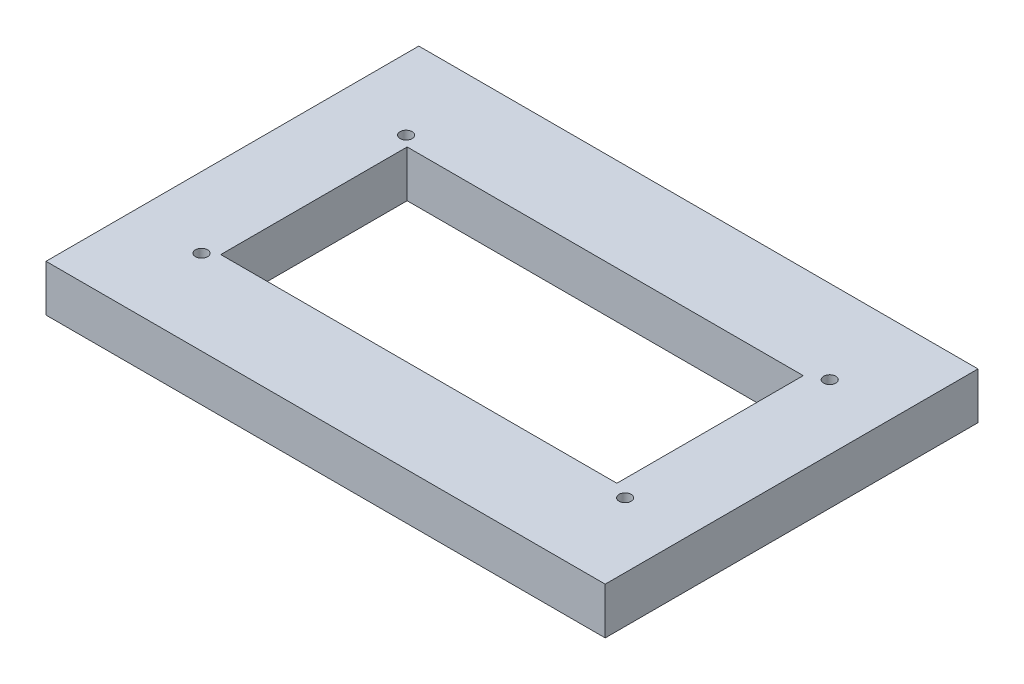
from build123d import *

# Parameters (mm, degrees)
SKETCH1_W           = 304.8
SKETCH1_H           = 203.2
BOSS_EXTRUDE1_DEPTH = 25.4
SKETCH2_W           = 215.9
SKETCH2_H           = 101.6
CUT_EXTRUDE1_DEPTH  = 185.914791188
SKETCH3_R           = 3.3
CUT_EXTRUDE2_DEPTH  = 185.914791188


with BuildPart() as part:
    # Sketch1 → Boss-Extrude1 (new body)
    with BuildSketch(Plane(origin=(0, 0, 0), x_dir=(1, 0, 0), z_dir=(0, 1, 0))):
        Rectangle(SKETCH1_W, SKETCH1_H)
    extrude(amount=BOSS_EXTRUDE1_DEPTH)

    # Sketch2 → Cut-Extrude1 (cut, through all)
    with BuildSketch(Plane(origin=(0, 25.4, 0), x_dir=(1, 0, 0), z_dir=(0, 1, 0))):
        Rectangle(SKETCH2_W, SKETCH2_H)
    extrude(amount=-CUT_EXTRUDE1_DEPTH, mode=Mode.SUBTRACT)

    # Sketch3 → Cut-Extrude2 (cut, through all)
    with BuildSketch(Plane(origin=(0, 25.4, 0), x_dir=(1, 0, 0), z_dir=(0, 1, 0))):
        with Locations(Location((-113.812107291, 56.104199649, 0), (0, 0, 270))):
            Circle(SKETCH3_R)
        with Locations(Location((-113.812107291, -55.409257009, 0), (0, 0, 270))):
            Circle(SKETCH3_R)
        with Locations(Location((117.071822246, -55.409257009, 0), (0, 0, 270))):
            Circle(SKETCH3_R)
        with Locations(Location((117.071822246, 56.104199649, 0), (0, 0, 270))):
            Circle(SKETCH3_R)
    extrude(amount=-CUT_EXTRUDE2_DEPTH, mode=Mode.SUBTRACT)


solid = part.part
